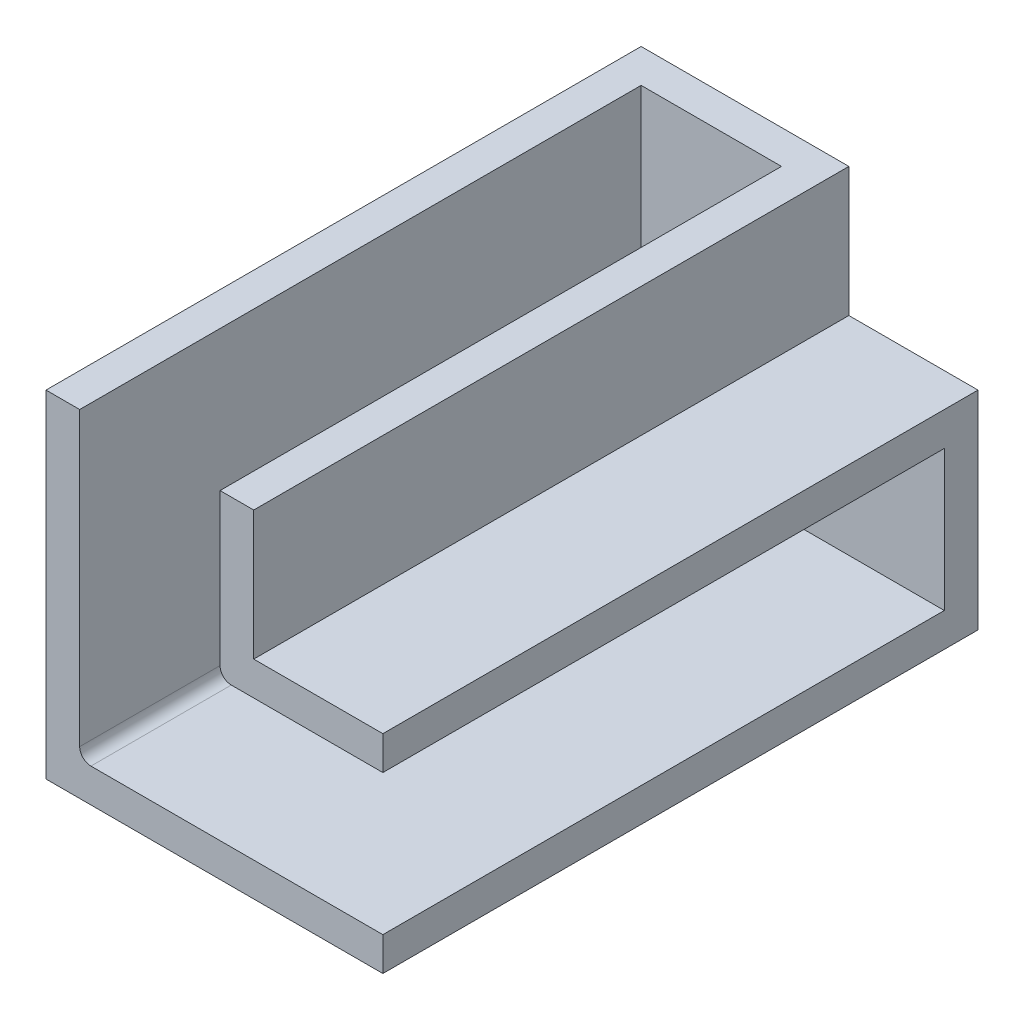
ISO-10303-21;
HEADER;
FILE_DESCRIPTION(('STEP AP214'),'2;1');
FILE_NAME('part.step','',(''),(''),'','','');
FILE_SCHEMA(('AUTOMOTIVE_DESIGN { 1 0 10303 214 1 1 1 1 }'));
ENDSEC;
DATA;
#1=APPLICATION_CONTEXT('core data for automotive mechanical design processes');
#2=APPLICATION_PROTOCOL_DEFINITION('international standard','automotive_design',2000,#1);
#3=PRODUCT_CONTEXT('',#1,'mechanical');
#4=PRODUCT('Part','Part','',(#3));
#5=PRODUCT_RELATED_PRODUCT_CATEGORY('part','',(#4));
#6=PRODUCT_DEFINITION_FORMATION('','',#4);
#7=PRODUCT_DEFINITION_CONTEXT('part definition',#1,'design');
#8=PRODUCT_DEFINITION('design','',#6,#7);
#9=PRODUCT_DEFINITION_SHAPE('','',#8);
#10=(LENGTH_UNIT() NAMED_UNIT(*) SI_UNIT(.MILLI.,.METRE.));
#11=(NAMED_UNIT(*) PLANE_ANGLE_UNIT() SI_UNIT($,.RADIAN.));
#12=(NAMED_UNIT(*) SI_UNIT($,.STERADIAN.) SOLID_ANGLE_UNIT());
#13=UNCERTAINTY_MEASURE_WITH_UNIT(LENGTH_MEASURE(1.E-05),#10,'distance_accuracy_value','');
#14=(GEOMETRIC_REPRESENTATION_CONTEXT(3) GLOBAL_UNCERTAINTY_ASSIGNED_CONTEXT((#13)) GLOBAL_UNIT_ASSIGNED_CONTEXT((#10,
#11,#12)) REPRESENTATION_CONTEXT('',''));
#15=CARTESIAN_POINT('',(0.,0.,0.));
#16=DIRECTION('',(0.,0.,1.));
#17=DIRECTION('',(1.,0.,0.));
#18=AXIS2_PLACEMENT_3D('',#15,#16,#17);
#19=CARTESIAN_POINT('',(0.,0.,53.));
#20=DIRECTION('',(0.,0.,1.));
#21=DIRECTION('',(1.,0.,0.));
#22=AXIS2_PLACEMENT_3D('',#19,#20,#21);
#23=PLANE('',#22);
#24=DIRECTION('',(0.,-1.,0.));
#25=VECTOR('',#24,1.);
#26=CARTESIAN_POINT('',(-47.5714285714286,-7.35714285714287,53.));
#27=LINE('',#26,#25);
#28=CARTESIAN_POINT('',(-47.5714285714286,-7.35714285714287,53.));
#29=VERTEX_POINT('',#28);
#30=CARTESIAN_POINT('',(-47.5714285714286,-33.3571428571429,53.));
#31=VERTEX_POINT('',#30);
#32=EDGE_CURVE('E149',#29,#31,#27,.T.);
#33=ORIENTED_EDGE('',*,*,#32,.F.);
#34=DIRECTION('',(-1.,0.,0.));
#35=VECTOR('',#34,1.);
#36=CARTESIAN_POINT('',(-50.5714285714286,-7.35714285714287,53.));
#37=LINE('',#36,#35);
#38=CARTESIAN_POINT('',(-50.5714285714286,-7.35714285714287,53.));
#39=VERTEX_POINT('',#38);
#40=EDGE_CURVE('E175',#29,#39,#37,.T.);
#41=ORIENTED_EDGE('',*,*,#40,.T.);
#42=DIRECTION('',(0.,-1.,0.));
#43=VECTOR('',#42,1.);
#44=CARTESIAN_POINT('',(-50.5714285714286,-7.35714285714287,53.));
#45=LINE('',#44,#43);
#46=CARTESIAN_POINT('',(-50.5714285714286,-37.3571428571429,53.));
#47=VERTEX_POINT('',#46);
#48=EDGE_CURVE('E192',#39,#47,#45,.T.);
#49=ORIENTED_EDGE('',*,*,#48,.T.);
#50=DIRECTION('',(1.,0.,0.));
#51=VECTOR('',#50,1.);
#52=CARTESIAN_POINT('',(-50.5714285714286,-37.3571428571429,53.));
#53=LINE('',#52,#51);
#54=CARTESIAN_POINT('',(-20.5714285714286,-37.3571428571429,53.));
#55=VERTEX_POINT('',#54);
#56=EDGE_CURVE('E164',#47,#55,#53,.T.);
#57=ORIENTED_EDGE('',*,*,#56,.T.);
#58=DIRECTION('',(0.,1.,0.));
#59=VECTOR('',#58,1.);
#60=CARTESIAN_POINT('',(-20.5714285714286,-18.8571428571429,53.));
#61=LINE('',#60,#59);
#62=CARTESIAN_POINT('',(-20.5714285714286,-34.3571428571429,53.));
#63=VERTEX_POINT('',#62);
#64=EDGE_CURVE('E156',#55,#63,#61,.T.);
#65=ORIENTED_EDGE('',*,*,#64,.T.);
#66=DIRECTION('',(1.,0.,0.));
#67=VECTOR('',#66,1.);
#68=CARTESIAN_POINT('',(-50.5714285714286,-34.3571428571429,53.));
#69=LINE('',#68,#67);
#70=CARTESIAN_POINT('',(-46.5714285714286,-34.3571428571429,53.));
#71=VERTEX_POINT('',#70);
#72=EDGE_CURVE('E137',#71,#63,#69,.T.);
#73=ORIENTED_EDGE('',*,*,#72,.F.);
#74=CARTESIAN_POINT('',(-46.5714285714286,-33.3571428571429,53.));
#75=DIRECTION('',(0.,0.,1.));
#76=DIRECTION('',(1.,0.,0.));
#77=AXIS2_PLACEMENT_3D('',#74,#75,#76);
#78=CIRCLE('',#77,1.);
#79=EDGE_CURVE('E43',#71,#31,#78,.F.);
#80=ORIENTED_EDGE('',*,*,#79,.T.);
#81=EDGE_LOOP('',(#33,#41,#49,#57,#65,#73,#80));
#82=FACE_BOUND('',#81,.T.);
#83=ADVANCED_FACE('F35',(#82),#23,.T.);
#84=CARTESIAN_POINT('',(-50.5714285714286,-7.35714285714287,53.));
#85=DIRECTION('',(1.,0.,0.));
#86=DIRECTION('',(0.,0.,-1.));
#87=AXIS2_PLACEMENT_3D('',#84,#85,#86);
#88=PLANE('',#87);
#89=DIRECTION('',(0.,-1.,0.));
#90=VECTOR('',#89,1.);
#91=CARTESIAN_POINT('',(-50.5714285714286,-7.35714285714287,0.));
#92=LINE('',#91,#90);
#93=CARTESIAN_POINT('',(-50.5714285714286,-7.35714285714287,0.));
#94=VERTEX_POINT('',#93);
#95=CARTESIAN_POINT('',(-50.5714285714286,-37.3571428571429,0.));
#96=VERTEX_POINT('',#95);
#97=EDGE_CURVE('E159',#94,#96,#92,.T.);
#98=ORIENTED_EDGE('',*,*,#97,.T.);
#99=DIRECTION('',(0.,0.,-1.));
#100=VECTOR('',#99,1.);
#101=CARTESIAN_POINT('',(-50.5714285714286,-37.3571428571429,53.));
#102=LINE('',#101,#100);
#103=EDGE_CURVE('E206',#47,#96,#102,.T.);
#104=ORIENTED_EDGE('',*,*,#103,.F.);
#105=ORIENTED_EDGE('',*,*,#48,.F.);
#106=DIRECTION('',(0.,0.,-1.));
#107=VECTOR('',#106,1.);
#108=CARTESIAN_POINT('',(-50.5714285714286,-7.35714285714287,53.));
#109=LINE('',#108,#107);
#110=EDGE_CURVE('E179',#39,#94,#109,.T.);
#111=ORIENTED_EDGE('',*,*,#110,.T.);
#112=EDGE_LOOP('',(#98,#104,#105,#111));
#113=FACE_BOUND('',#112,.T.);
#114=ADVANCED_FACE('F257',(#113),#88,.F.);
#115=CARTESIAN_POINT('',(-50.5714285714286,-37.3571428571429,53.));
#116=DIRECTION('',(0.,1.,0.));
#117=DIRECTION('',(0.,0.,1.));
#118=AXIS2_PLACEMENT_3D('',#115,#116,#117);
#119=PLANE('',#118);
#120=DIRECTION('',(1.,0.,0.));
#121=VECTOR('',#120,1.);
#122=CARTESIAN_POINT('',(-50.5714285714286,-37.3571428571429,0.));
#123=LINE('',#122,#121);
#124=CARTESIAN_POINT('',(-20.5714285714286,-37.3571428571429,0.));
#125=VERTEX_POINT('',#124);
#126=EDGE_CURVE('E182',#96,#125,#123,.T.);
#127=ORIENTED_EDGE('',*,*,#126,.T.);
#128=DIRECTION('',(0.,0.,-1.));
#129=VECTOR('',#128,1.);
#130=CARTESIAN_POINT('',(-20.5714285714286,-37.3571428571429,53.));
#131=LINE('',#130,#129);
#132=EDGE_CURVE('E204',#55,#125,#131,.T.);
#133=ORIENTED_EDGE('',*,*,#132,.F.);
#134=ORIENTED_EDGE('',*,*,#56,.F.);
#135=ORIENTED_EDGE('',*,*,#103,.T.);
#136=EDGE_LOOP('',(#127,#133,#134,#135));
#137=FACE_BOUND('',#136,.T.);
#138=ADVANCED_FACE('F260',(#137),#119,.F.);
#139=CARTESIAN_POINT('',(-20.5714285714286,-18.8571428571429,53.));
#140=DIRECTION('',(-1.,0.,0.));
#141=DIRECTION('',(0.,0.,1.));
#142=AXIS2_PLACEMENT_3D('',#139,#140,#141);
#143=PLANE('',#142);
#144=CARTESIAN_POINT('',(-20.5714285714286,-21.8571428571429,53.));
#145=VERTEX_POINT('',#144);
#146=CARTESIAN_POINT('',(-20.5714285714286,-18.8571428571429,53.));
#147=VERTEX_POINT('',#146);
#148=EDGE_CURVE('E167',#145,#147,#61,.T.);
#149=ORIENTED_EDGE('',*,*,#148,.F.);
#150=DIRECTION('',(0.,0.,-1.));
#151=VECTOR('',#150,1.);
#152=CARTESIAN_POINT('',(-20.5714285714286,-21.8571428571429,53.));
#153=LINE('',#152,#151);
#154=CARTESIAN_POINT('',(-20.5714285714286,-21.8571428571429,3.));
#155=VERTEX_POINT('',#154);
#156=EDGE_CURVE('E160',#145,#155,#153,.T.);
#157=ORIENTED_EDGE('',*,*,#156,.T.);
#158=DIRECTION('',(0.,1.,0.));
#159=VECTOR('',#158,1.);
#160=CARTESIAN_POINT('',(-20.5714285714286,-18.8571428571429,3.));
#161=LINE('',#160,#159);
#162=CARTESIAN_POINT('',(-20.5714285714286,-34.3571428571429,3.));
#163=VERTEX_POINT('',#162);
#164=EDGE_CURVE('E158',#163,#155,#161,.T.);
#165=ORIENTED_EDGE('',*,*,#164,.F.);
#166=DIRECTION('',(0.,0.,-1.));
#167=VECTOR('',#166,1.);
#168=CARTESIAN_POINT('',(-20.5714285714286,-34.3571428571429,53.));
#169=LINE('',#168,#167);
#170=EDGE_CURVE('E141',#63,#163,#169,.T.);
#171=ORIENTED_EDGE('',*,*,#170,.F.);
#172=ORIENTED_EDGE('',*,*,#64,.F.);
#173=ORIENTED_EDGE('',*,*,#132,.T.);
#174=DIRECTION('',(0.,1.,0.));
#175=VECTOR('',#174,1.);
#176=CARTESIAN_POINT('',(-20.5714285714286,-18.8571428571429,0.));
#177=LINE('',#176,#175);
#178=CARTESIAN_POINT('',(-20.5714285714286,-18.8571428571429,0.));
#179=VERTEX_POINT('',#178);
#180=EDGE_CURVE('E184',#125,#179,#177,.T.);
#181=ORIENTED_EDGE('',*,*,#180,.T.);
#182=DIRECTION('',(0.,0.,-1.));
#183=VECTOR('',#182,1.);
#184=CARTESIAN_POINT('',(-20.5714285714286,-18.8571428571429,53.));
#185=LINE('',#184,#183);
#186=EDGE_CURVE('E201',#147,#179,#185,.T.);
#187=ORIENTED_EDGE('',*,*,#186,.F.);
#188=EDGE_LOOP('',(#149,#157,#165,#171,#172,#173,#181,#187));
#189=FACE_BOUND('',#188,.T.);
#190=ADVANCED_FACE('F154',(#189),#143,.F.);
#191=CARTESIAN_POINT('',(-32.0714285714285,-18.8571428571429,53.));
#192=DIRECTION('',(0.,-1.,0.));
#193=DIRECTION('',(0.,0.,-1.));
#194=AXIS2_PLACEMENT_3D('',#191,#192,#193);
#195=PLANE('',#194);
#196=DIRECTION('',(-1.,0.,0.));
#197=VECTOR('',#196,1.);
#198=CARTESIAN_POINT('',(-32.0714285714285,-18.8571428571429,0.));
#199=LINE('',#198,#197);
#200=CARTESIAN_POINT('',(-32.0714285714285,-18.8571428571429,0.));
#201=VERTEX_POINT('',#200);
#202=EDGE_CURVE('E186',#179,#201,#199,.T.);
#203=ORIENTED_EDGE('',*,*,#202,.T.);
#204=DIRECTION('',(0.,0.,-1.));
#205=VECTOR('',#204,1.);
#206=CARTESIAN_POINT('',(-32.0714285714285,-18.8571428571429,53.));
#207=LINE('',#206,#205);
#208=CARTESIAN_POINT('',(-32.0714285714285,-18.8571428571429,53.));
#209=VERTEX_POINT('',#208);
#210=EDGE_CURVE('E198',#209,#201,#207,.T.);
#211=ORIENTED_EDGE('',*,*,#210,.F.);
#212=DIRECTION('',(-1.,0.,0.));
#213=VECTOR('',#212,1.);
#214=CARTESIAN_POINT('',(-32.0714285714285,-18.8571428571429,53.));
#215=LINE('',#214,#213);
#216=EDGE_CURVE('E166',#147,#209,#215,.T.);
#217=ORIENTED_EDGE('',*,*,#216,.F.);
#218=ORIENTED_EDGE('',*,*,#186,.T.);
#219=EDGE_LOOP('',(#203,#211,#217,#218));
#220=FACE_BOUND('',#219,.T.);
#221=ADVANCED_FACE('F270',(#220),#195,.F.);
#222=CARTESIAN_POINT('',(-32.0714285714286,-7.35714285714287,53.));
#223=DIRECTION('',(-1.,0.,0.));
#224=DIRECTION('',(0.,-1.,0.));
#225=AXIS2_PLACEMENT_3D('',#222,#223,#224);
#226=PLANE('',#225);
#227=DIRECTION('',(0.,1.,0.));
#228=VECTOR('',#227,1.);
#229=CARTESIAN_POINT('',(-32.0714285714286,-7.35714285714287,0.));
#230=LINE('',#229,#228);
#231=CARTESIAN_POINT('',(-32.0714285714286,-7.35714285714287,0.));
#232=VERTEX_POINT('',#231);
#233=EDGE_CURVE('E188',#201,#232,#230,.T.);
#234=ORIENTED_EDGE('',*,*,#233,.T.);
#235=DIRECTION('',(0.,0.,-1.));
#236=VECTOR('',#235,1.);
#237=CARTESIAN_POINT('',(-32.0714285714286,-7.35714285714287,53.));
#238=LINE('',#237,#236);
#239=CARTESIAN_POINT('',(-32.0714285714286,-7.35714285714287,53.));
#240=VERTEX_POINT('',#239);
#241=EDGE_CURVE('E195',#240,#232,#238,.T.);
#242=ORIENTED_EDGE('',*,*,#241,.F.);
#243=DIRECTION('',(0.,1.,0.));
#244=VECTOR('',#243,1.);
#245=CARTESIAN_POINT('',(-32.0714285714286,-7.35714285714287,53.));
#246=LINE('',#245,#244);
#247=EDGE_CURVE('E169',#209,#240,#246,.T.);
#248=ORIENTED_EDGE('',*,*,#247,.F.);
#249=ORIENTED_EDGE('',*,*,#210,.T.);
#250=EDGE_LOOP('',(#234,#242,#248,#249));
#251=FACE_BOUND('',#250,.T.);
#252=ADVANCED_FACE('F274',(#251),#226,.F.);
#253=CARTESIAN_POINT('',(-50.5714285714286,-7.35714285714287,53.));
#254=DIRECTION('',(0.,-1.,0.));
#255=DIRECTION('',(0.,0.,-1.));
#256=AXIS2_PLACEMENT_3D('',#253,#254,#255);
#257=PLANE('',#256);
#258=ORIENTED_EDGE('',*,*,#40,.F.);
#259=DIRECTION('',(0.,0.,-1.));
#260=VECTOR('',#259,1.);
#261=CARTESIAN_POINT('',(-47.5714285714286,-7.35714285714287,53.));
#262=LINE('',#261,#260);
#263=CARTESIAN_POINT('',(-47.5714285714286,-7.35714285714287,3.));
#264=VERTEX_POINT('',#263);
#265=EDGE_CURVE('E228',#29,#264,#262,.T.);
#266=ORIENTED_EDGE('',*,*,#265,.T.);
#267=DIRECTION('',(-1.,0.,0.));
#268=VECTOR('',#267,1.);
#269=CARTESIAN_POINT('',(-50.5714285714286,-7.35714285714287,3.));
#270=LINE('',#269,#268);
#271=CARTESIAN_POINT('',(-35.0714285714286,-7.35714285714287,3.));
#272=VERTEX_POINT('',#271);
#273=EDGE_CURVE('E229',#272,#264,#270,.T.);
#274=ORIENTED_EDGE('',*,*,#273,.F.);
#275=DIRECTION('',(0.,0.,-1.));
#276=VECTOR('',#275,1.);
#277=CARTESIAN_POINT('',(-35.0714285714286,-7.35714285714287,53.));
#278=LINE('',#277,#276);
#279=CARTESIAN_POINT('',(-35.0714285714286,-7.35714285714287,53.));
#280=VERTEX_POINT('',#279);
#281=EDGE_CURVE('E246',#280,#272,#278,.T.);
#282=ORIENTED_EDGE('',*,*,#281,.F.);
#283=EDGE_CURVE('E176',#240,#280,#37,.T.);
#284=ORIENTED_EDGE('',*,*,#283,.F.);
#285=ORIENTED_EDGE('',*,*,#241,.T.);
#286=DIRECTION('',(-1.,0.,0.));
#287=VECTOR('',#286,1.);
#288=CARTESIAN_POINT('',(-50.5714285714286,-7.35714285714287,0.));
#289=LINE('',#288,#287);
#290=EDGE_CURVE('E190',#232,#94,#289,.T.);
#291=ORIENTED_EDGE('',*,*,#290,.T.);
#292=ORIENTED_EDGE('',*,*,#110,.F.);
#293=EDGE_LOOP('',(#258,#266,#274,#282,#284,#285,#291,#292));
#294=FACE_BOUND('',#293,.T.);
#295=ADVANCED_FACE('F299',(#294),#257,.F.);
#296=DIRECTION('',(0.,1.,0.));
#297=VECTOR('',#296,1.);
#298=CARTESIAN_POINT('',(-35.0714285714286,-7.35714285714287,53.));
#299=LINE('',#298,#297);
#300=CARTESIAN_POINT('',(-35.0714285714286,-20.8571428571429,53.));
#301=VERTEX_POINT('',#300);
#302=EDGE_CURVE('E248',#301,#280,#299,.T.);
#303=ORIENTED_EDGE('',*,*,#302,.F.);
#304=CARTESIAN_POINT('',(-34.0714285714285,-20.8571428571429,53.));
#305=DIRECTION('',(0.,0.,1.));
#306=DIRECTION('',(1.,0.,0.));
#307=AXIS2_PLACEMENT_3D('',#304,#305,#306);
#308=CIRCLE('',#307,1.);
#309=CARTESIAN_POINT('',(-34.0714285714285,-21.8571428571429,53.));
#310=VERTEX_POINT('',#309);
#311=EDGE_CURVE('E57',#301,#310,#308,.T.);
#312=ORIENTED_EDGE('',*,*,#311,.T.);
#313=DIRECTION('',(-1.,0.,0.));
#314=VECTOR('',#313,1.);
#315=CARTESIAN_POINT('',(-32.0714285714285,-21.8571428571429,53.));
#316=LINE('',#315,#314);
#317=EDGE_CURVE('E148',#145,#310,#316,.T.);
#318=ORIENTED_EDGE('',*,*,#317,.F.);
#319=ORIENTED_EDGE('',*,*,#148,.T.);
#320=ORIENTED_EDGE('',*,*,#216,.T.);
#321=ORIENTED_EDGE('',*,*,#247,.T.);
#322=ORIENTED_EDGE('',*,*,#283,.T.);
#323=EDGE_LOOP('',(#303,#312,#318,#319,#320,#321,#322));
#324=FACE_BOUND('',#323,.T.);
#325=ADVANCED_FACE('F277',(#324),#23,.T.);
#326=CARTESIAN_POINT('',(0.,0.,0.));
#327=DIRECTION('',(0.,0.,1.));
#328=DIRECTION('',(1.,0.,0.));
#329=AXIS2_PLACEMENT_3D('',#326,#327,#328);
#330=PLANE('',#329);
#331=ORIENTED_EDGE('',*,*,#97,.F.);
#332=ORIENTED_EDGE('',*,*,#290,.F.);
#333=ORIENTED_EDGE('',*,*,#233,.F.);
#334=ORIENTED_EDGE('',*,*,#202,.F.);
#335=ORIENTED_EDGE('',*,*,#180,.F.);
#336=ORIENTED_EDGE('',*,*,#126,.F.);
#337=EDGE_LOOP('',(#331,#332,#333,#334,#335,#336));
#338=FACE_BOUND('',#337,.T.);
#339=ADVANCED_FACE('F265',(#338),#330,.F.);
#340=CARTESIAN_POINT('',(-47.5714285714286,-7.35714285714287,53.));
#341=DIRECTION('',(1.,0.,0.));
#342=DIRECTION('',(0.,0.,-1.));
#343=AXIS2_PLACEMENT_3D('',#340,#341,#342);
#344=PLANE('',#343);
#345=ORIENTED_EDGE('',*,*,#32,.T.);
#346=DIRECTION('',(0.,0.,-1.));
#347=VECTOR('',#346,1.);
#348=CARTESIAN_POINT('',(-47.5714285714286,-33.3571428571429,3.));
#349=LINE('',#348,#347);
#350=CARTESIAN_POINT('',(-47.5714285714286,-33.3571428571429,3.));
#351=VERTEX_POINT('',#350);
#352=EDGE_CURVE('E209',#31,#351,#349,.T.);
#353=ORIENTED_EDGE('',*,*,#352,.T.);
#354=DIRECTION('',(0.,-1.,0.));
#355=VECTOR('',#354,1.);
#356=CARTESIAN_POINT('',(-47.5714285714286,-7.35714285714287,3.));
#357=LINE('',#356,#355);
#358=EDGE_CURVE('E235',#264,#351,#357,.T.);
#359=ORIENTED_EDGE('',*,*,#358,.F.);
#360=ORIENTED_EDGE('',*,*,#265,.F.);
#361=EDGE_LOOP('',(#345,#353,#359,#360));
#362=FACE_BOUND('',#361,.T.);
#363=ADVANCED_FACE('F224',(#362),#344,.T.);
#364=CARTESIAN_POINT('',(-50.5714285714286,-34.3571428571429,53.));
#365=DIRECTION('',(0.,1.,0.));
#366=DIRECTION('',(0.,0.,1.));
#367=AXIS2_PLACEMENT_3D('',#364,#365,#366);
#368=PLANE('',#367);
#369=DIRECTION('',(1.,0.,0.));
#370=VECTOR('',#369,1.);
#371=CARTESIAN_POINT('',(-50.5714285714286,-34.3571428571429,3.));
#372=LINE('',#371,#370);
#373=CARTESIAN_POINT('',(-46.5714285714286,-34.3571428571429,3.));
#374=VERTEX_POINT('',#373);
#375=EDGE_CURVE('E234',#374,#163,#372,.T.);
#376=ORIENTED_EDGE('',*,*,#375,.F.);
#377=DIRECTION('',(0.,0.,-1.));
#378=VECTOR('',#377,1.);
#379=CARTESIAN_POINT('',(-46.5714285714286,-34.3571428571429,53.));
#380=LINE('',#379,#378);
#381=EDGE_CURVE('E144',#374,#71,#380,.F.);
#382=ORIENTED_EDGE('',*,*,#381,.T.);
#383=ORIENTED_EDGE('',*,*,#72,.T.);
#384=ORIENTED_EDGE('',*,*,#170,.T.);
#385=EDGE_LOOP('',(#376,#382,#383,#384));
#386=FACE_BOUND('',#385,.T.);
#387=ADVANCED_FACE('F140',(#386),#368,.T.);
#388=CARTESIAN_POINT('',(-32.0714285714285,-21.8571428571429,53.));
#389=DIRECTION('',(0.,-1.,0.));
#390=DIRECTION('',(0.,0.,-1.));
#391=AXIS2_PLACEMENT_3D('',#388,#389,#390);
#392=PLANE('',#391);
#393=ORIENTED_EDGE('',*,*,#317,.T.);
#394=DIRECTION('',(0.,0.,-1.));
#395=VECTOR('',#394,1.);
#396=CARTESIAN_POINT('',(-34.0714285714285,-21.8571428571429,53.));
#397=LINE('',#396,#395);
#398=CARTESIAN_POINT('',(-34.0714285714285,-21.8571428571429,3.));
#399=VERTEX_POINT('',#398);
#400=EDGE_CURVE('E215',#310,#399,#397,.T.);
#401=ORIENTED_EDGE('',*,*,#400,.T.);
#402=DIRECTION('',(-1.,0.,0.));
#403=VECTOR('',#402,1.);
#404=CARTESIAN_POINT('',(-32.0714285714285,-21.8571428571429,3.));
#405=LINE('',#404,#403);
#406=EDGE_CURVE('E237',#155,#399,#405,.T.);
#407=ORIENTED_EDGE('',*,*,#406,.F.);
#408=ORIENTED_EDGE('',*,*,#156,.F.);
#409=EDGE_LOOP('',(#393,#401,#407,#408));
#410=FACE_BOUND('',#409,.T.);
#411=ADVANCED_FACE('F280',(#410),#392,.T.);
#412=CARTESIAN_POINT('',(-35.0714285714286,-7.35714285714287,53.));
#413=DIRECTION('',(-1.,0.,0.));
#414=DIRECTION('',(0.,-1.,0.));
#415=AXIS2_PLACEMENT_3D('',#412,#413,#414);
#416=PLANE('',#415);
#417=DIRECTION('',(0.,1.,0.));
#418=VECTOR('',#417,1.);
#419=CARTESIAN_POINT('',(-35.0714285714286,-7.35714285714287,3.));
#420=LINE('',#419,#418);
#421=CARTESIAN_POINT('',(-35.0714285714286,-20.8571428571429,3.));
#422=VERTEX_POINT('',#421);
#423=EDGE_CURVE('E241',#422,#272,#420,.T.);
#424=ORIENTED_EDGE('',*,*,#423,.F.);
#425=DIRECTION('',(0.,0.,-1.));
#426=VECTOR('',#425,1.);
#427=CARTESIAN_POINT('',(-35.0714285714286,-20.8571428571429,53.));
#428=LINE('',#427,#426);
#429=EDGE_CURVE('E50',#422,#301,#428,.F.);
#430=ORIENTED_EDGE('',*,*,#429,.T.);
#431=ORIENTED_EDGE('',*,*,#302,.T.);
#432=ORIENTED_EDGE('',*,*,#281,.T.);
#433=EDGE_LOOP('',(#424,#430,#431,#432));
#434=FACE_BOUND('',#433,.T.);
#435=ADVANCED_FACE('F283',(#434),#416,.T.);
#436=CARTESIAN_POINT('',(0.,0.,3.));
#437=DIRECTION('',(0.,0.,1.));
#438=DIRECTION('',(1.,0.,0.));
#439=AXIS2_PLACEMENT_3D('',#436,#437,#438);
#440=PLANE('',#439);
#441=ORIENTED_EDGE('',*,*,#358,.T.);
#442=CARTESIAN_POINT('',(-46.5714285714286,-33.3571428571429,3.));
#443=DIRECTION('',(0.,0.,1.));
#444=DIRECTION('',(1.,0.,0.));
#445=AXIS2_PLACEMENT_3D('',#442,#443,#444);
#446=CIRCLE('',#445,1.);
#447=EDGE_CURVE('E212',#351,#374,#446,.T.);
#448=ORIENTED_EDGE('',*,*,#447,.T.);
#449=ORIENTED_EDGE('',*,*,#375,.T.);
#450=ORIENTED_EDGE('',*,*,#164,.T.);
#451=ORIENTED_EDGE('',*,*,#406,.T.);
#452=CARTESIAN_POINT('',(-34.0714285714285,-20.8571428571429,3.));
#453=DIRECTION('',(0.,0.,1.));
#454=DIRECTION('',(1.,0.,0.));
#455=AXIS2_PLACEMENT_3D('',#452,#453,#454);
#456=CIRCLE('',#455,1.);
#457=EDGE_CURVE('E11',#399,#422,#456,.F.);
#458=ORIENTED_EDGE('',*,*,#457,.T.);
#459=ORIENTED_EDGE('',*,*,#423,.T.);
#460=ORIENTED_EDGE('',*,*,#273,.T.);
#461=EDGE_LOOP('',(#441,#448,#449,#450,#451,#458,#459,#460));
#462=FACE_BOUND('',#461,.T.);
#463=ADVANCED_FACE('F233',(#462),#440,.T.);
#464=CARTESIAN_POINT('',(-46.5714285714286,-33.3571428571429,53.));
#465=DIRECTION('',(0.,0.,1.));
#466=DIRECTION('',(1.,0.,0.));
#467=AXIS2_PLACEMENT_3D('',#464,#465,#466);
#468=CYLINDRICAL_SURFACE('',#467,1.);
#469=ORIENTED_EDGE('',*,*,#79,.F.);
#470=ORIENTED_EDGE('',*,*,#381,.F.);
#471=ORIENTED_EDGE('',*,*,#447,.F.);
#472=ORIENTED_EDGE('',*,*,#352,.F.);
#473=EDGE_LOOP('',(#469,#470,#471,#472));
#474=FACE_BOUND('',#473,.T.);
#475=ADVANCED_FACE('F231',(#474),#468,.F.);
#476=CARTESIAN_POINT('',(-34.0714285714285,-20.8571428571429,53.));
#477=DIRECTION('',(0.,0.,-1.));
#478=DIRECTION('',(-1.,0.,0.));
#479=AXIS2_PLACEMENT_3D('',#476,#477,#478);
#480=CYLINDRICAL_SURFACE('',#479,1.);
#481=ORIENTED_EDGE('',*,*,#311,.F.);
#482=ORIENTED_EDGE('',*,*,#429,.F.);
#483=ORIENTED_EDGE('',*,*,#457,.F.);
#484=ORIENTED_EDGE('',*,*,#400,.F.);
#485=EDGE_LOOP('',(#481,#482,#483,#484));
#486=FACE_BOUND('',#485,.T.);
#487=ADVANCED_FACE('F37',(#486),#480,.T.);
#488=CLOSED_SHELL('',(#83,#114,#138,#190,#221,#252,#295,#325,#339,#363,#387,#411,#435,#463,#475,#487));
#489=MANIFOLD_SOLID_BREP('B2',#488);
#490=ADVANCED_BREP_SHAPE_REPRESENTATION('',(#18,#489),#14);
#491=SHAPE_DEFINITION_REPRESENTATION(#9,#490);
ENDSEC;
END-ISO-10303-21;
